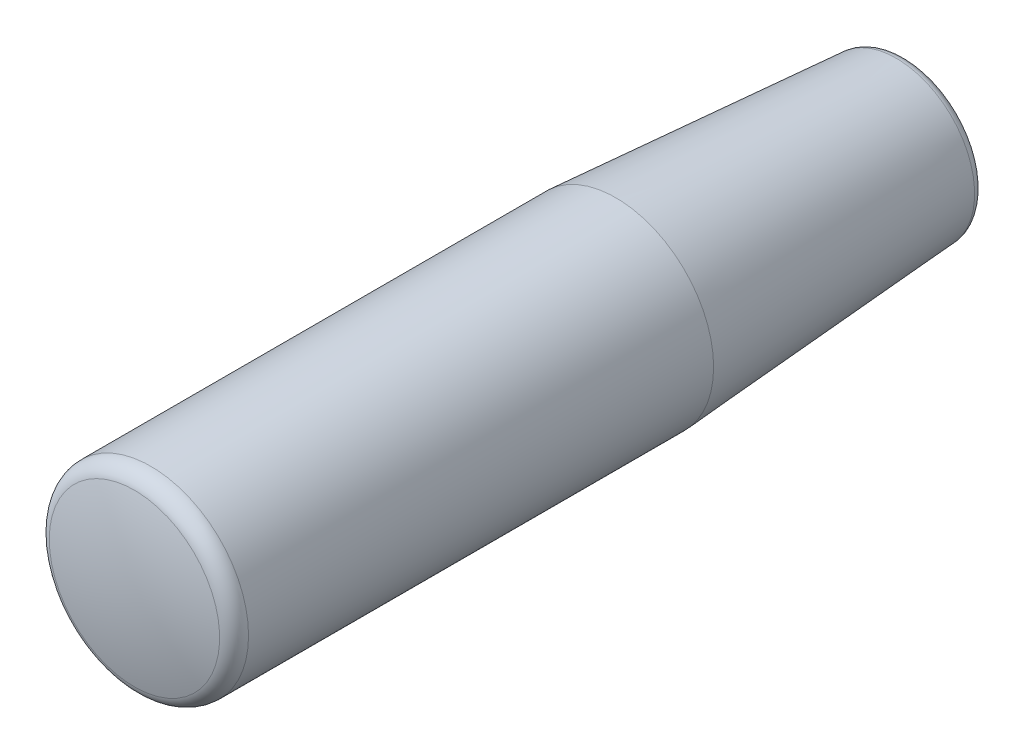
ISO-10303-21;
HEADER;
FILE_DESCRIPTION(('STEP AP214'),'2;1');
FILE_NAME('part.step','',(''),(''),'','','');
FILE_SCHEMA(('AUTOMOTIVE_DESIGN { 1 0 10303 214 1 1 1 1 }'));
ENDSEC;
DATA;
#1=APPLICATION_CONTEXT('core data for automotive mechanical design processes');
#2=APPLICATION_PROTOCOL_DEFINITION('international standard','automotive_design',2000,#1);
#3=PRODUCT_CONTEXT('',#1,'mechanical');
#4=PRODUCT('Part','Part','',(#3));
#5=PRODUCT_RELATED_PRODUCT_CATEGORY('part','',(#4));
#6=PRODUCT_DEFINITION_FORMATION('','',#4);
#7=PRODUCT_DEFINITION_CONTEXT('part definition',#1,'design');
#8=PRODUCT_DEFINITION('design','',#6,#7);
#9=PRODUCT_DEFINITION_SHAPE('','',#8);
#10=(LENGTH_UNIT() NAMED_UNIT(*) SI_UNIT(.MILLI.,.METRE.));
#11=(NAMED_UNIT(*) PLANE_ANGLE_UNIT() SI_UNIT($,.RADIAN.));
#12=(NAMED_UNIT(*) SI_UNIT($,.STERADIAN.) SOLID_ANGLE_UNIT());
#13=UNCERTAINTY_MEASURE_WITH_UNIT(LENGTH_MEASURE(1.E-05),#10,'distance_accuracy_value','');
#14=(GEOMETRIC_REPRESENTATION_CONTEXT(3) GLOBAL_UNCERTAINTY_ASSIGNED_CONTEXT((#13)) GLOBAL_UNIT_ASSIGNED_CONTEXT((#10,
#11,#12)) REPRESENTATION_CONTEXT('',''));
#15=CARTESIAN_POINT('',(0.,0.,0.));
#16=DIRECTION('',(0.,0.,1.));
#17=DIRECTION('',(1.,0.,0.));
#18=AXIS2_PLACEMENT_3D('',#15,#16,#17);
#19=CARTESIAN_POINT('',(0.,6.25,8.));
#20=DIRECTION('',(0.,0.,1.));
#21=DIRECTION('',(1.,0.,0.));
#22=AXIS2_PLACEMENT_3D('',#19,#20,#21);
#23=PLANE('',#22);
#24=CARTESIAN_POINT('',(0.,0.,8.));
#25=DIRECTION('',(0.,0.,-1.));
#26=DIRECTION('',(-1.,0.,0.));
#27=AXIS2_PLACEMENT_3D('',#24,#25,#26);
#28=CIRCLE('',#27,6.);
#29=CARTESIAN_POINT('',(-6.,0.,8.));
#30=VERTEX_POINT('',#29);
#31=EDGE_CURVE('E8',#30,#30,#28,.T.);
#32=ORIENTED_EDGE('',*,*,#31,.F.);
#33=EDGE_LOOP('',(#32));
#34=FACE_BOUND('',#33,.T.);
#35=CARTESIAN_POINT('',(0.,0.,8.));
#36=DIRECTION('',(0.,0.,-1.));
#37=DIRECTION('',(-1.,0.,0.));
#38=AXIS2_PLACEMENT_3D('',#35,#36,#37);
#39=CIRCLE('',#38,6.25);
#40=CARTESIAN_POINT('',(-6.25,0.,8.));
#41=VERTEX_POINT('',#40);
#42=EDGE_CURVE('E43',#41,#41,#39,.T.);
#43=ORIENTED_EDGE('',*,*,#42,.T.);
#44=EDGE_LOOP('',(#43));
#45=FACE_BOUND('',#44,.T.);
#46=ADVANCED_FACE('F12',(#34,#45),#23,.F.);
#47=CARTESIAN_POINT('',(0.,0.,-5.));
#48=DIRECTION('',(0.,0.,-1.));
#49=DIRECTION('',(-1.,0.,0.));
#50=AXIS2_PLACEMENT_3D('',#47,#48,#49);
#51=CYLINDRICAL_SURFACE('',#50,6.);
#52=CARTESIAN_POINT('',(0.,0.,58.));
#53=DIRECTION('',(0.,0.,-1.));
#54=DIRECTION('',(-1.,0.,0.));
#55=AXIS2_PLACEMENT_3D('',#52,#53,#54);
#56=CIRCLE('',#55,6.);
#57=CARTESIAN_POINT('',(-6.,0.,58.));
#58=VERTEX_POINT('',#57);
#59=EDGE_CURVE('E18',#58,#58,#56,.T.);
#60=ORIENTED_EDGE('',*,*,#59,.F.);
#61=EDGE_LOOP('',(#60));
#62=FACE_BOUND('',#61,.T.);
#63=ORIENTED_EDGE('',*,*,#31,.T.);
#64=EDGE_LOOP('',(#63));
#65=FACE_BOUND('',#64,.T.);
#66=ADVANCED_FACE('F68',(#62,#65),#51,.F.);
#67=CARTESIAN_POINT('',(0.,0.,58.));
#68=DIRECTION('',(0.,0.,-1.));
#69=DIRECTION('',(-1.,0.,0.));
#70=AXIS2_PLACEMENT_3D('',#67,#68,#69);
#71=PLANE('',#70);
#72=ORIENTED_EDGE('',*,*,#59,.T.);
#73=EDGE_LOOP('',(#72));
#74=FACE_BOUND('',#73,.T.);
#75=ADVANCED_FACE('F74',(#74),#71,.T.);
#76=CARTESIAN_POINT('',(0.,0.,66.));
#77=DIRECTION('',(-1.,0.,0.));
#78=DIRECTION('',(0.,0.,1.));
#79=AXIS2_PLACEMENT_3D('',#76,#77,#78);
#80=SPHERICAL_SURFACE('',#79,50.);
#81=CARTESIAN_POINT('',(0.,0.,66.));
#82=DIRECTION('',(0.,0.,-1.));
#83=DIRECTION('',(-1.,0.,0.));
#84=AXIS2_PLACEMENT_3D('',#81,#82,#83);
#85=SPHERICAL_SURFACE('',#84,50.);
#86=CARTESIAN_POINT('',(0.,0.,114.378127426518));
#87=DIRECTION('',(0.,0.,-1.));
#88=DIRECTION('',(-1.,0.,0.));
#89=AXIS2_PLACEMENT_3D('',#86,#87,#88);
#90=CIRCLE('',#89,12.6315789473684);
#91=CARTESIAN_POINT('',(-12.6315789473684,0.,114.378127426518));
#92=VERTEX_POINT('',#91);
#93=EDGE_CURVE('E22',#92,#92,#90,.T.);
#94=ORIENTED_EDGE('',*,*,#93,.F.);
#95=EDGE_LOOP('',(#94));
#96=FACE_BOUND('',#95,.T.);
#97=ADVANCED_FACE('F80',(#96),#85,.T.);
#98=CARTESIAN_POINT('',(0.,0.,111.959221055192));
#99=DIRECTION('',(0.,0.,-1.));
#100=DIRECTION('',(-1.,0.,0.));
#101=AXIS2_PLACEMENT_3D('',#98,#99,#100);
#102=TOROIDAL_SURFACE('',#101,12.,2.5);
#103=CARTESIAN_POINT('',(0.,0.,111.959221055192));
#104=DIRECTION('',(0.,0.,-1.));
#105=DIRECTION('',(-1.,0.,0.));
#106=AXIS2_PLACEMENT_3D('',#103,#104,#105);
#107=CIRCLE('',#106,14.5);
#108=CARTESIAN_POINT('',(-14.5,0.,111.959221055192));
#109=VERTEX_POINT('',#108);
#110=EDGE_CURVE('E26',#109,#109,#107,.T.);
#111=ORIENTED_EDGE('',*,*,#110,.F.);
#112=EDGE_LOOP('',(#111));
#113=FACE_BOUND('',#112,.T.);
#114=ORIENTED_EDGE('',*,*,#93,.T.);
#115=EDGE_LOOP('',(#114));
#116=FACE_BOUND('',#115,.T.);
#117=ADVANCED_FACE('F85',(#113,#116),#102,.T.);
#118=CARTESIAN_POINT('',(0.,0.,-5.));
#119=DIRECTION('',(0.,0.,-1.));
#120=DIRECTION('',(-1.,0.,0.));
#121=AXIS2_PLACEMENT_3D('',#118,#119,#120);
#122=CYLINDRICAL_SURFACE('',#121,14.5);
#123=ORIENTED_EDGE('',*,*,#110,.T.);
#124=EDGE_LOOP('',(#123));
#125=FACE_BOUND('',#124,.T.);
#126=CARTESIAN_POINT('',(0.,0.,43.));
#127=DIRECTION('',(0.,0.,-1.));
#128=DIRECTION('',(-1.,0.,0.));
#129=AXIS2_PLACEMENT_3D('',#126,#127,#128);
#130=CIRCLE('',#129,14.5);
#131=CARTESIAN_POINT('',(-14.5,0.,43.));
#132=VERTEX_POINT('',#131);
#133=EDGE_CURVE('E31',#132,#132,#130,.T.);
#134=ORIENTED_EDGE('',*,*,#133,.F.);
#135=EDGE_LOOP('',(#134));
#136=FACE_BOUND('',#135,.T.);
#137=ADVANCED_FACE('F89',(#125,#136),#122,.T.);
#138=CARTESIAN_POINT('',(0.,0.,1.39560260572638));
#139=DIRECTION('',(0.,0.,1.));
#140=DIRECTION('',(1.,0.,0.));
#141=AXIS2_PLACEMENT_3D('',#138,#139,#140);
#142=CONICAL_SURFACE('',#141,11.5973676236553,0.0696545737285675);
#143=ORIENTED_EDGE('',*,*,#133,.T.);
#144=EDGE_LOOP('',(#143));
#145=FACE_BOUND('',#144,.T.);
#146=CARTESIAN_POINT('',(0.,0.,1.39560260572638));
#147=DIRECTION('',(0.,0.,-1.));
#148=DIRECTION('',(-1.,0.,0.));
#149=AXIS2_PLACEMENT_3D('',#146,#147,#148);
#150=CIRCLE('',#149,11.5973676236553);
#151=CARTESIAN_POINT('',(-11.5973676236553,0.,1.39560260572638));
#152=VERTEX_POINT('',#151);
#153=EDGE_CURVE('E34',#152,#152,#150,.T.);
#154=ORIENTED_EDGE('',*,*,#153,.F.);
#155=EDGE_LOOP('',(#154));
#156=FACE_BOUND('',#155,.T.);
#157=ADVANCED_FACE('F64',(#145,#156),#142,.T.);
#158=CARTESIAN_POINT('',(0.,0.,1.5));
#159=DIRECTION('',(0.,0.,-1.));
#160=DIRECTION('',(-1.,0.,0.));
#161=AXIS2_PLACEMENT_3D('',#158,#159,#160);
#162=TOROIDAL_SURFACE('',#161,10.101004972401,1.5);
#163=CARTESIAN_POINT('',(0.,0.,0.));
#164=DIRECTION('',(0.,0.,-1.));
#165=DIRECTION('',(-1.,0.,0.));
#166=AXIS2_PLACEMENT_3D('',#163,#164,#165);
#167=CIRCLE('',#166,10.101004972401);
#168=CARTESIAN_POINT('',(-10.101004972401,0.,0.));
#169=VERTEX_POINT('',#168);
#170=EDGE_CURVE('E37',#169,#169,#167,.T.);
#171=ORIENTED_EDGE('',*,*,#170,.F.);
#172=EDGE_LOOP('',(#171));
#173=FACE_BOUND('',#172,.T.);
#174=ORIENTED_EDGE('',*,*,#153,.T.);
#175=EDGE_LOOP('',(#174));
#176=FACE_BOUND('',#175,.T.);
#177=ADVANCED_FACE('F56',(#173,#176),#162,.T.);
#178=CARTESIAN_POINT('',(0.,6.25,0.));
#179=DIRECTION('',(0.,0.,-1.));
#180=DIRECTION('',(-1.,0.,0.));
#181=AXIS2_PLACEMENT_3D('',#178,#179,#180);
#182=PLANE('',#181);
#183=ORIENTED_EDGE('',*,*,#170,.T.);
#184=EDGE_LOOP('',(#183));
#185=FACE_BOUND('',#184,.T.);
#186=CARTESIAN_POINT('',(0.,0.,0.));
#187=DIRECTION('',(0.,0.,-1.));
#188=DIRECTION('',(-1.,0.,0.));
#189=AXIS2_PLACEMENT_3D('',#186,#187,#188);
#190=CIRCLE('',#189,6.25);
#191=CARTESIAN_POINT('',(-6.25,0.,0.));
#192=VERTEX_POINT('',#191);
#193=EDGE_CURVE('E40',#192,#192,#190,.T.);
#194=ORIENTED_EDGE('',*,*,#193,.F.);
#195=EDGE_LOOP('',(#194));
#196=FACE_BOUND('',#195,.T.);
#197=ADVANCED_FACE('F51',(#185,#196),#182,.T.);
#198=CARTESIAN_POINT('',(0.,0.,-5.));
#199=DIRECTION('',(0.,0.,-1.));
#200=DIRECTION('',(-1.,0.,0.));
#201=AXIS2_PLACEMENT_3D('',#198,#199,#200);
#202=CYLINDRICAL_SURFACE('',#201,6.25);
#203=ORIENTED_EDGE('',*,*,#42,.F.);
#204=EDGE_LOOP('',(#203));
#205=FACE_BOUND('',#204,.T.);
#206=ORIENTED_EDGE('',*,*,#193,.T.);
#207=EDGE_LOOP('',(#206));
#208=FACE_BOUND('',#207,.T.);
#209=ADVANCED_FACE('F48',(#205,#208),#202,.F.);
#210=CLOSED_SHELL('',(#46,#66,#75,#97,#117,#137,#157,#177,#197,#209));
#211=MANIFOLD_SOLID_BREP('B1',#210);
#212=ADVANCED_BREP_SHAPE_REPRESENTATION('',(#18,#211),#14);
#213=SHAPE_DEFINITION_REPRESENTATION(#9,#212);
ENDSEC;
END-ISO-10303-21;
